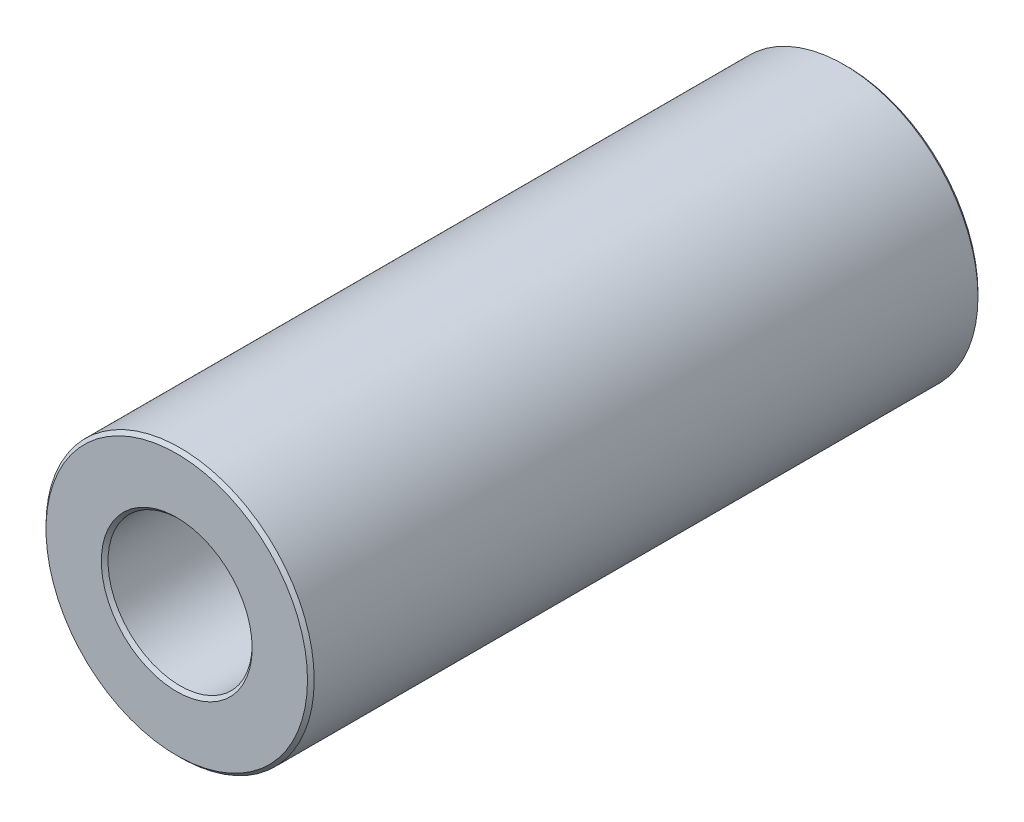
ISO-10303-21;
HEADER;
FILE_DESCRIPTION(('STEP AP214'),'2;1');
FILE_NAME('part.step','',(''),(''),'','','');
FILE_SCHEMA(('AUTOMOTIVE_DESIGN { 1 0 10303 214 1 1 1 1 }'));
ENDSEC;
DATA;
#1=APPLICATION_CONTEXT('core data for automotive mechanical design processes');
#2=APPLICATION_PROTOCOL_DEFINITION('international standard','automotive_design',2000,#1);
#3=PRODUCT_CONTEXT('',#1,'mechanical');
#4=PRODUCT('Part','Part','',(#3));
#5=PRODUCT_RELATED_PRODUCT_CATEGORY('part','',(#4));
#6=PRODUCT_DEFINITION_FORMATION('','',#4);
#7=PRODUCT_DEFINITION_CONTEXT('part definition',#1,'design');
#8=PRODUCT_DEFINITION('design','',#6,#7);
#9=PRODUCT_DEFINITION_SHAPE('','',#8);
#10=(LENGTH_UNIT() NAMED_UNIT(*) SI_UNIT(.MILLI.,.METRE.));
#11=(NAMED_UNIT(*) PLANE_ANGLE_UNIT() SI_UNIT($,.RADIAN.));
#12=(NAMED_UNIT(*) SI_UNIT($,.STERADIAN.) SOLID_ANGLE_UNIT());
#13=UNCERTAINTY_MEASURE_WITH_UNIT(LENGTH_MEASURE(1.E-05),#10,'distance_accuracy_value','');
#14=(GEOMETRIC_REPRESENTATION_CONTEXT(3) GLOBAL_UNCERTAINTY_ASSIGNED_CONTEXT((#13)) GLOBAL_UNIT_ASSIGNED_CONTEXT((#10,
#11,#12)) REPRESENTATION_CONTEXT('',''));
#15=CARTESIAN_POINT('',(0.,0.,0.));
#16=DIRECTION('',(0.,0.,1.));
#17=DIRECTION('',(1.,0.,0.));
#18=AXIS2_PLACEMENT_3D('',#15,#16,#17);
#19=CARTESIAN_POINT('',(0.,0.,10.));
#20=DIRECTION('',(0.,0.,1.));
#21=DIRECTION('',(1.,0.,0.));
#22=AXIS2_PLACEMENT_3D('',#19,#20,#21);
#23=PLANE('',#22);
#24=CARTESIAN_POINT('',(0.,0.,10.));
#25=DIRECTION('',(0.,0.,1.));
#26=DIRECTION('',(1.,0.,0.));
#27=AXIS2_PLACEMENT_3D('',#24,#25,#26);
#28=CIRCLE('',#27,2.25);
#29=CARTESIAN_POINT('',(2.25,0.,10.));
#30=VERTEX_POINT('',#29);
#31=EDGE_CURVE('E10',#30,#30,#28,.F.);
#32=ORIENTED_EDGE('',*,*,#31,.T.);
#33=EDGE_LOOP('',(#32));
#34=FACE_BOUND('',#33,.T.);
#35=CARTESIAN_POINT('',(0.,0.,10.));
#36=DIRECTION('',(0.,0.,1.));
#37=DIRECTION('',(1.,0.,0.));
#38=AXIS2_PLACEMENT_3D('',#35,#36,#37);
#39=CIRCLE('',#38,3.9);
#40=CARTESIAN_POINT('',(3.9,0.,10.));
#41=VERTEX_POINT('',#40);
#42=EDGE_CURVE('E45',#41,#41,#39,.T.);
#43=ORIENTED_EDGE('',*,*,#42,.T.);
#44=EDGE_LOOP('',(#43));
#45=FACE_BOUND('',#44,.T.);
#46=ADVANCED_FACE('F37',(#34,#45),#23,.T.);
#47=CARTESIAN_POINT('',(0.,0.,-10.));
#48=DIRECTION('',(0.,0.,1.));
#49=DIRECTION('',(1.,0.,0.));
#50=AXIS2_PLACEMENT_3D('',#47,#48,#49);
#51=PLANE('',#50);
#52=CARTESIAN_POINT('',(0.,0.,-10.));
#53=DIRECTION('',(0.,0.,1.));
#54=DIRECTION('',(1.,0.,0.));
#55=AXIS2_PLACEMENT_3D('',#52,#53,#54);
#56=CIRCLE('',#55,3.9);
#57=CARTESIAN_POINT('',(3.9,0.,-10.));
#58=VERTEX_POINT('',#57);
#59=EDGE_CURVE('E63',#58,#58,#56,.F.);
#60=ORIENTED_EDGE('',*,*,#59,.T.);
#61=EDGE_LOOP('',(#60));
#62=FACE_BOUND('',#61,.T.);
#63=CARTESIAN_POINT('',(0.,0.,-10.));
#64=DIRECTION('',(0.,0.,1.));
#65=DIRECTION('',(1.,0.,0.));
#66=AXIS2_PLACEMENT_3D('',#63,#64,#65);
#67=CIRCLE('',#66,2.25);
#68=CARTESIAN_POINT('',(2.25,0.,-10.));
#69=VERTEX_POINT('',#68);
#70=EDGE_CURVE('E67',#69,#69,#67,.T.);
#71=ORIENTED_EDGE('',*,*,#70,.T.);
#72=EDGE_LOOP('',(#71));
#73=FACE_BOUND('',#72,.T.);
#74=ADVANCED_FACE('F89',(#62,#73),#51,.F.);
#75=CARTESIAN_POINT('',(0.,0.,10.));
#76=DIRECTION('',(0.,0.,-1.));
#77=DIRECTION('',(-1.,0.,0.));
#78=AXIS2_PLACEMENT_3D('',#75,#76,#77);
#79=CYLINDRICAL_SURFACE('',#78,4.);
#80=CARTESIAN_POINT('',(0.,0.,-9.89999999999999));
#81=DIRECTION('',(0.,0.,1.));
#82=DIRECTION('',(1.,0.,0.));
#83=AXIS2_PLACEMENT_3D('',#80,#81,#82);
#84=CIRCLE('',#83,4.);
#85=CARTESIAN_POINT('',(4.,0.,-9.89999999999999));
#86=VERTEX_POINT('',#85);
#87=EDGE_CURVE('E70',#86,#86,#84,.T.);
#88=ORIENTED_EDGE('',*,*,#87,.T.);
#89=EDGE_LOOP('',(#88));
#90=FACE_BOUND('',#89,.T.);
#91=CARTESIAN_POINT('',(0.,0.,9.9));
#92=DIRECTION('',(0.,0.,1.));
#93=DIRECTION('',(1.,0.,0.));
#94=AXIS2_PLACEMENT_3D('',#91,#92,#93);
#95=CIRCLE('',#94,4.);
#96=CARTESIAN_POINT('',(4.,0.,9.9));
#97=VERTEX_POINT('',#96);
#98=EDGE_CURVE('E74',#97,#97,#95,.F.);
#99=ORIENTED_EDGE('',*,*,#98,.T.);
#100=EDGE_LOOP('',(#99));
#101=FACE_BOUND('',#100,.T.);
#102=ADVANCED_FACE('F78',(#90,#101),#79,.T.);
#103=CARTESIAN_POINT('',(0.,0.,10.));
#104=DIRECTION('',(0.,0.,-1.));
#105=DIRECTION('',(-1.,0.,0.));
#106=AXIS2_PLACEMENT_3D('',#103,#104,#105);
#107=CYLINDRICAL_SURFACE('',#106,2.15);
#108=CARTESIAN_POINT('',(0.,0.,-9.9));
#109=DIRECTION('',(0.,0.,1.));
#110=DIRECTION('',(1.,0.,0.));
#111=AXIS2_PLACEMENT_3D('',#108,#109,#110);
#112=CIRCLE('',#111,2.15);
#113=CARTESIAN_POINT('',(2.15,0.,-9.9));
#114=VERTEX_POINT('',#113);
#115=EDGE_CURVE('E51',#114,#114,#112,.F.);
#116=ORIENTED_EDGE('',*,*,#115,.T.);
#117=EDGE_LOOP('',(#116));
#118=FACE_BOUND('',#117,.T.);
#119=CARTESIAN_POINT('',(0.,0.,9.9));
#120=DIRECTION('',(0.,0.,1.));
#121=DIRECTION('',(1.,0.,0.));
#122=AXIS2_PLACEMENT_3D('',#119,#120,#121);
#123=CIRCLE('',#122,2.15);
#124=CARTESIAN_POINT('',(2.15,0.,9.9));
#125=VERTEX_POINT('',#124);
#126=EDGE_CURVE('E57',#125,#125,#123,.T.);
#127=ORIENTED_EDGE('',*,*,#126,.T.);
#128=EDGE_LOOP('',(#127));
#129=FACE_BOUND('',#128,.T.);
#130=ADVANCED_FACE('F97',(#118,#129),#107,.F.);
#131=CARTESIAN_POINT('',(0.,0.,-9.89999999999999));
#132=DIRECTION('',(0.,0.,1.));
#133=DIRECTION('',(1.,0.,0.));
#134=AXIS2_PLACEMENT_3D('',#131,#132,#133);
#135=CONICAL_SURFACE('',#134,4.,0.78539816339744);
#136=ORIENTED_EDGE('',*,*,#59,.F.);
#137=EDGE_LOOP('',(#136));
#138=FACE_BOUND('',#137,.T.);
#139=ORIENTED_EDGE('',*,*,#87,.F.);
#140=EDGE_LOOP('',(#139));
#141=FACE_BOUND('',#140,.T.);
#142=ADVANCED_FACE('F102',(#138,#141),#135,.T.);
#143=CARTESIAN_POINT('',(0.,0.,-10.));
#144=DIRECTION('',(0.,0.,-1.));
#145=DIRECTION('',(-1.,0.,0.));
#146=AXIS2_PLACEMENT_3D('',#143,#144,#145);
#147=CONICAL_SURFACE('',#146,2.25,0.785398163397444);
#148=ORIENTED_EDGE('',*,*,#115,.F.);
#149=EDGE_LOOP('',(#148));
#150=FACE_BOUND('',#149,.T.);
#151=ORIENTED_EDGE('',*,*,#70,.F.);
#152=EDGE_LOOP('',(#151));
#153=FACE_BOUND('',#152,.T.);
#154=ADVANCED_FACE('F86',(#150,#153),#147,.F.);
#155=CARTESIAN_POINT('',(0.,0.,9.9));
#156=DIRECTION('',(0.,0.,1.));
#157=DIRECTION('',(1.,0.,0.));
#158=AXIS2_PLACEMENT_3D('',#155,#156,#157);
#159=CONICAL_SURFACE('',#158,2.15,0.785398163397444);
#160=ORIENTED_EDGE('',*,*,#31,.F.);
#161=EDGE_LOOP('',(#160));
#162=FACE_BOUND('',#161,.T.);
#163=ORIENTED_EDGE('',*,*,#126,.F.);
#164=EDGE_LOOP('',(#163));
#165=FACE_BOUND('',#164,.T.);
#166=ADVANCED_FACE('F82',(#162,#165),#159,.F.);
#167=CARTESIAN_POINT('',(0.,0.,10.));
#168=DIRECTION('',(0.,0.,-1.));
#169=DIRECTION('',(-1.,0.,0.));
#170=AXIS2_PLACEMENT_3D('',#167,#168,#169);
#171=CONICAL_SURFACE('',#170,3.9,0.785398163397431);
#172=ORIENTED_EDGE('',*,*,#98,.F.);
#173=EDGE_LOOP('',(#172));
#174=FACE_BOUND('',#173,.T.);
#175=ORIENTED_EDGE('',*,*,#42,.F.);
#176=EDGE_LOOP('',(#175));
#177=FACE_BOUND('',#176,.T.);
#178=ADVANCED_FACE('F39',(#174,#177),#171,.T.);
#179=CLOSED_SHELL('',(#46,#74,#102,#130,#142,#154,#166,#178));
#180=MANIFOLD_SOLID_BREP('B2',#179);
#181=ADVANCED_BREP_SHAPE_REPRESENTATION('',(#18,#180),#14);
#182=SHAPE_DEFINITION_REPRESENTATION(#9,#181);
ENDSEC;
END-ISO-10303-21;
